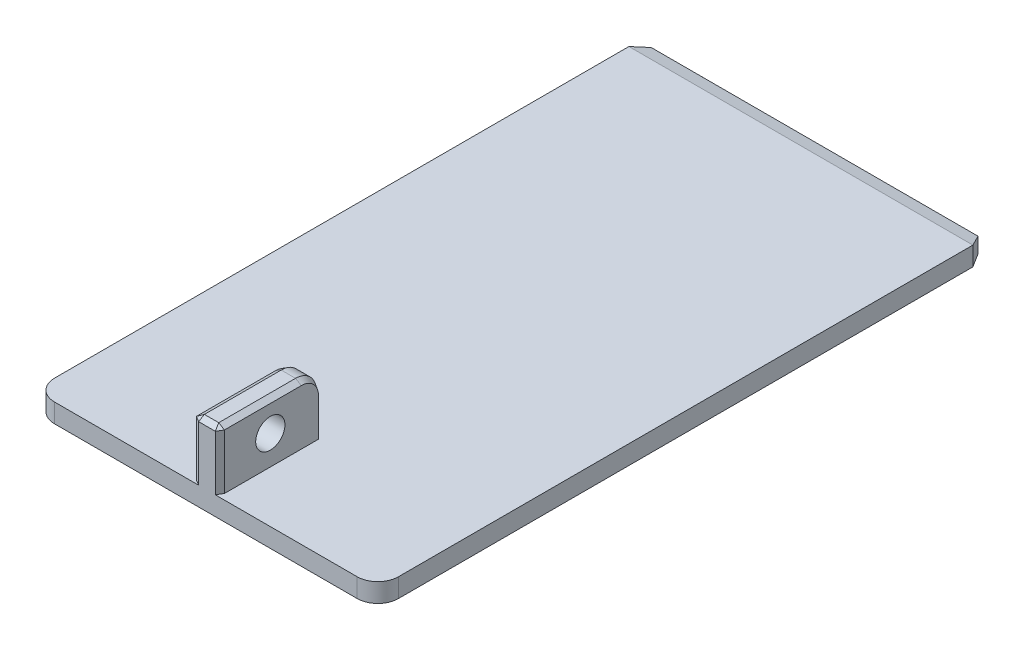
from build123d import *
from OCP.BRepFilletAPI import BRepFilletAPI_MakeChamfer

# Parameters (mm, degrees)
SKIZZE1_W                       = 100
SKIZZE1_H                       = 5.5
AUFSATZ_LINEAR_AUSTRAGEN1_DEPTH = 177
FASE1_SIZE                      = 2.5
FASE1_SIZE2                     = 4
FASE2_SIZE                      = 1
FASE2_SIZE2                     = 4
SKIZZE2_W                       = 7.5
SKIZZE2_H                       = 30
AUFSATZ_LINEAR_AUSTRAGEN2_DEPTH = 17
SKIZZE3_R                       = 4.25
SCHNITT_LINEAR_AUSTRAGEN1_DEPTH = 187.032591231
VERRUNDUNG1_R                   = 6
VERRUNDUNG2_R                   = 6
FASE3_SIZE                      = 1
FASE3_SIZE2                     = 1.664279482


with BuildPart() as part:
    # Skizze1 → Aufsatz-Linear austragen1 (new body)
    with BuildSketch(Plane.XY):
        Rectangle(SKIZZE1_W, SKIZZE1_H)
    extrude(amount=AUFSATZ_LINEAR_AUSTRAGEN1_DEPTH)

    # Fase1
    fase1_edges = [part.edges().sort_by_distance(p)[0] for p in [
        (-50, 0, 0),
        (50, 0, 0),
    ]]
    fase1_side = [part.faces().sort_by_distance(p)[0] for p in [
        (0, 0, 0),
    ]]
    chamfer(fase1_edges, length=FASE1_SIZE, length2=FASE1_SIZE2, reference=fase1_side[0])

    # Fase2
    fase2_edges = [part.edges().sort_by_distance(p)[0] for p in [
        (0, 2.75, 0),
    ]]
    fase2_side = [part.faces().sort_by_distance(p)[0] for p in [
        (0, 0, 0),
    ]]
    chamfer(fase2_edges, length=FASE2_SIZE, length2=FASE2_SIZE2, reference=fase2_side[0])

    # Skizze2 → Aufsatz-Linear austragen2 (add)
    with BuildSketch(Plane(origin=(0, 2.75, 0), x_dir=(1, 0, 0), z_dir=(0, 1, 0))):
        with Locations((0, -162)):
            Rectangle(SKIZZE2_W, SKIZZE2_H)
    extrude(amount=AUFSATZ_LINEAR_AUSTRAGEN2_DEPTH)

    # Skizze3 → Schnitt-Linear austragen1 (cut, through all)
    with BuildSketch(Plane(origin=(3.75, 0, 0), x_dir=(0, 0, -1), z_dir=(1, 0, 0))):
        with Locations((-162, 11.25)):
            Circle(SKIZZE3_R)
    extrude(amount=-SCHNITT_LINEAR_AUSTRAGEN1_DEPTH, mode=Mode.SUBTRACT)

    # Verrundung1
    verrundung1_edges = [part.edges().sort_by_distance(p)[0] for p in [
        (0, 19.75, 147),
    ]]
    fillet(verrundung1_edges, radius=VERRUNDUNG1_R)

    # Verrundung2
    verrundung2_edges = [part.edges().sort_by_distance(p)[0] for p in [
        (-50, 0, 177),
        (50, 0, 177),
    ]]
    fillet(verrundung2_edges, radius=VERRUNDUNG2_R)

    # Fase3: one chamfer whose edges measure the first distance from different faces: ONE call of the kernel's chamfer builder (chamfer() names one face for all edges)
    fase3_edges_1 = [part.edges().sort_by_distance(p)[0] for p in [
        (-3.75, 11.25, 177),
        (-3.75, 19.75, 165),
        (-3.75, 8.25, 147),
        (-3.75, 17.992640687, 148.757359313),
    ]]
    fase3_side_1 = [part.faces().sort_by_distance(p)[0] for p in [
        (-3.75, 19.405181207, 165),
    ]]
    fase3_edges_2 = [part.edges().sort_by_distance(p)[0] for p in [
        (3.75, 11.25, 177),
        (0, 19.75, 177),
    ]]
    fase3_side_2 = [part.faces().sort_by_distance(p)[0] for p in [
        (0, 2.345666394, 177),
    ]]
    fase3_edges_3 = [part.edges().sort_by_distance(p)[0] for p in [
        (3.75, 19.75, 165),
        (3.75, 8.25, 147),
        (3.75, 17.992640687, 148.757359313),
    ]]
    fase3_side_3 = [part.faces().sort_by_distance(p)[0] for p in [
        (3.75, 8.25, 147.344818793),
    ]]
    fase3 = BRepFilletAPI_MakeChamfer(part.part.solid().wrapped)
    for e in fase3_edges_1:
        fase3.Add(FASE3_SIZE, FASE3_SIZE2, e.wrapped, fase3_side_1[0].wrapped)  # the first distance lies on this face
    for e in fase3_edges_2:
        fase3.Add(FASE3_SIZE, FASE3_SIZE2, e.wrapped, fase3_side_2[0].wrapped)  # the first distance lies on this face
    for e in fase3_edges_3:
        fase3.Add(FASE3_SIZE, FASE3_SIZE2, e.wrapped, fase3_side_3[0].wrapped)  # the first distance lies on this face
    add(Compound.cast(fase3.Shape()), mode=Mode.REPLACE)


solid = part.part
